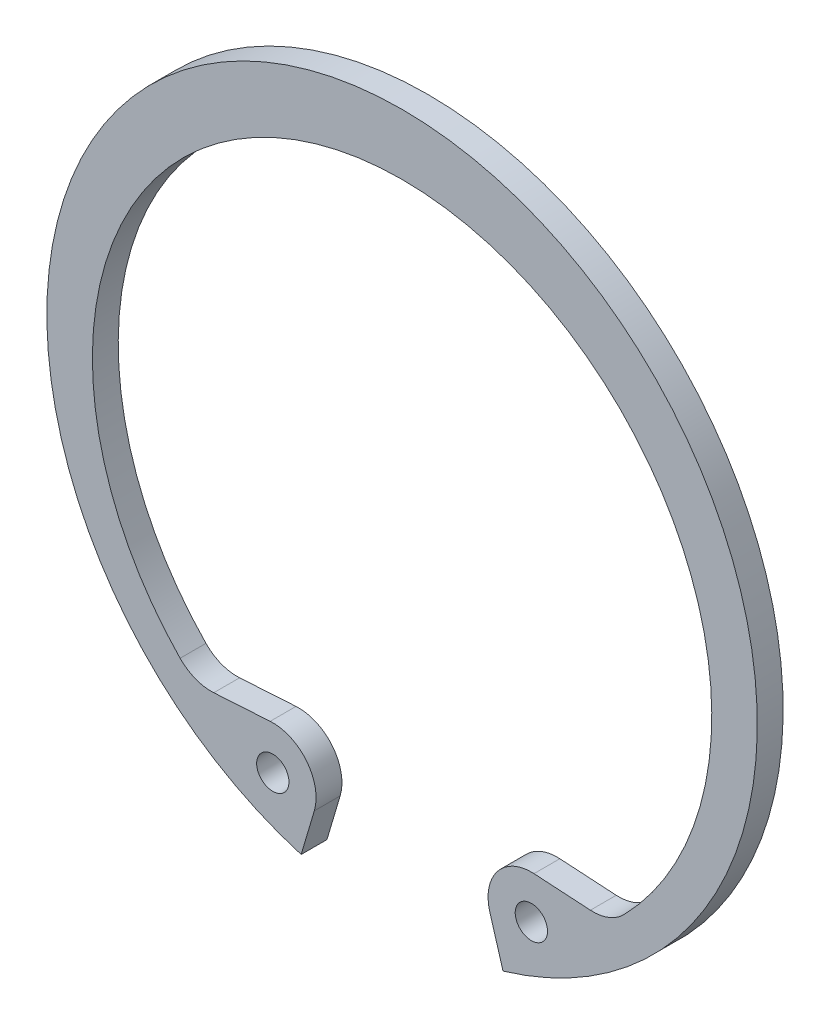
from build123d import *

# Parameters (mm, degrees)
ESQUISSE1_R          = 1.25
BASE_EXTRUSION_DEPTH = 2


with BuildPart() as part:
    # Esquisse1 → Base-Extrusion (new body)
    with BuildSketch(Plane.XY):
        with BuildLine():
            Line((6.796297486, -22.930554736), (7.814605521, -26.366303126))
            ThreePointArc((7.814605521, -26.366303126), (0, 27.5), (-7.814605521, -26.366303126))
            Line((-7.814605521, -26.366303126), (-6.796297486, -22.930554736))
            ThreePointArc((-6.796297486, -22.930554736), (-7.386124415, -19.893585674), (-10.212174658, -18.634809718))
            Line((-10.212174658, -18.634809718), (-14.579004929, -18.901201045))
            ThreePointArc((-14.579004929, -18.901201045), (-15.991593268, -18.681800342), (-17.184102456, -17.893470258))
            ThreePointArc((-17.184102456, -17.893470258), (0, 22.8), (17.184102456, -17.893470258))
            ThreePointArc((17.184102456, -17.893470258), (15.991593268, -18.681800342), (14.579004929, -18.901201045))
            Line((14.579004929, -18.901201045), (10.212174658, -18.634809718))
            ThreePointArc((10.212174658, -18.634809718), (7.386124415, -19.893585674), (6.796297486, -22.930554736))
        make_face()
        with Locations((10.008192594, -21.978593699)):
            Circle(ESQUISSE1_R, mode=Mode.SUBTRACT)
        with Locations(Location((-10.008192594, -21.978593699, 0), (0, 0, 180))):
            Circle(ESQUISSE1_R, mode=Mode.SUBTRACT)
    extrude(amount=BASE_EXTRUSION_DEPTH)


solid = part.part
